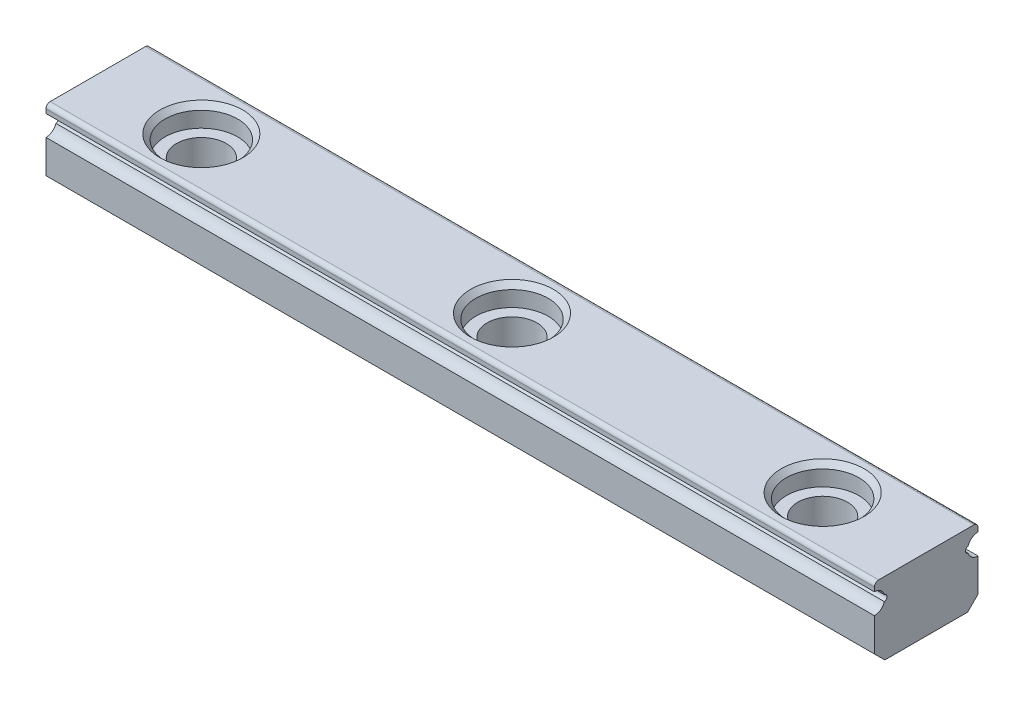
from build123d import *

# Parameters (mm, degrees)
EXTRUDE1_DEPTH     = 40
LPATTERN1_COUNT    = 3
LPATTERN1_PITCH    = 15
CUT_EXTRUDE1_DEPTH = 41.23058538
FILLET1_R          = 0.2


with BuildPart() as part:
    # Sketch 1 → Extrude1 (new body)
    with BuildSketch(Plane(origin=(0, 0, 0), x_dir=(0, 0, -1), z_dir=(1, 0, 0))):
        Polygon((-2, 0), (-2.5, 0.5), (-2.5, 3.5), (2.5, 3.5), (2.5, 0.5), (2, 0), align=None)
    extrude(amount=-EXTRUDE1_DEPTH)

    # Sketch 2 → HoleWzd1 (revolve, cut)
    with BuildSketch(Plane(origin=(-5, 3.5, 0), x_dir=(0, 0, 1), z_dir=(1, 0, 0))):
        Polygon((0, 0), (0, 3.5), (1.4, 3.5), (1.2, 3.3), (1.2, 1), (1.75, 1), (1.75, 0.25), (2, 0), align=None)
    holewzd1 = revolve(axis=Axis((-5, 9.85, 0), (0, -1, 0)), mode=Mode.SUBTRACT)

    # LPattern1: HoleWzd1 ×3
    with Locations(*[(-i * LPATTERN1_PITCH, 0, 0) for i in range(1, LPATTERN1_COUNT)]):
        add(holewzd1, mode=Mode.SUBTRACT)

    # Sketch1 → Cut-Extrude1 (cut, through all)
    with BuildSketch(Plane(origin=(0, 0, 0), x_dir=(0, 0, -1), z_dir=(1, 0, 0))):
        with BuildLine():
            ThreePointArc((2.022484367, 2.748252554), (1.895313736, 2.6), (2.022484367, 2.451747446))
            ThreePointArc((2.022484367, 2.451747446), (3, 2.6), (2.022484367, 2.748252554))
        make_face()
        with BuildLine():
            ThreePointArc((-2.022484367, 2.748252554), (-1.895313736, 2.6), (-2.022484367, 2.451747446))
            ThreePointArc((-2.022484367, 2.451747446), (-3, 2.6), (-2.022484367, 2.748252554))
        make_face()
    extrude(amount=-CUT_EXTRUDE1_DEPTH, mode=Mode.SUBTRACT)

    # Fillet1
    fillet1_edges = [part.edges().sort_by_distance(p)[0] for p in [
        (-20, 3.5, 2.5),
        (-20, 3.5, -2.5),
    ]]
    fillet(fillet1_edges, radius=FILLET1_R)


solid = part.part
